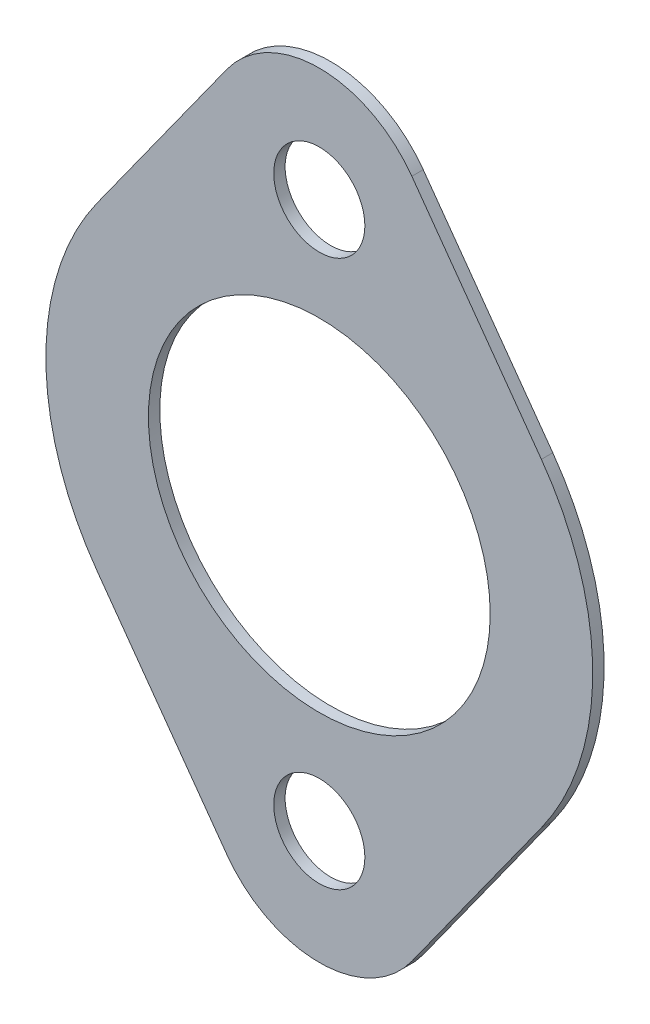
from build123d import *

# Parameters (mm, degrees)
MAIN_DEPTH  = 1.5875
SKETCH2_R   = 6.35
SKETCH2_R_2 = 23.8125
HOLES_DEPTH = 67.086540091


with BuildPart() as part:
    # Sketch1 → Main (new body)
    with BuildSketch(Plane.XY):
        with BuildLine():
            Line((12.894196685, 47.360416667), (30.946072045, 22.225))
            ThreePointArc((30.946072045, 22.225), (38.1, 0), (30.946072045, -22.225))
            Line((30.946072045, -22.225), (12.894196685, -47.360416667))
            ThreePointArc((12.894196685, -47.360416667), (0, -53.975), (-12.894196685, -47.360416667))
            Line((-12.894196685, -47.360416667), (-30.946072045, -22.225))
            ThreePointArc((-30.946072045, -22.225), (-38.1, 0), (-30.946072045, 22.225))
            Line((-30.946072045, 22.225), (-12.894196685, 47.360416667))
            ThreePointArc((-12.894196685, 47.360416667), (0, 53.975), (12.894196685, 47.360416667))
        make_face()
    extrude(amount=MAIN_DEPTH)

    # Sketch2 → Holes (cut, through all)
    with BuildSketch(Plane.XY.offset(1.5875)):
        with Locations((0, 38.1)):
            Circle(SKETCH2_R)
        with Locations((0, -38.1)):
            Circle(SKETCH2_R)
        Circle(SKETCH2_R_2)
    extrude(amount=-HOLES_DEPTH, mode=Mode.SUBTRACT)


solid = part.part
